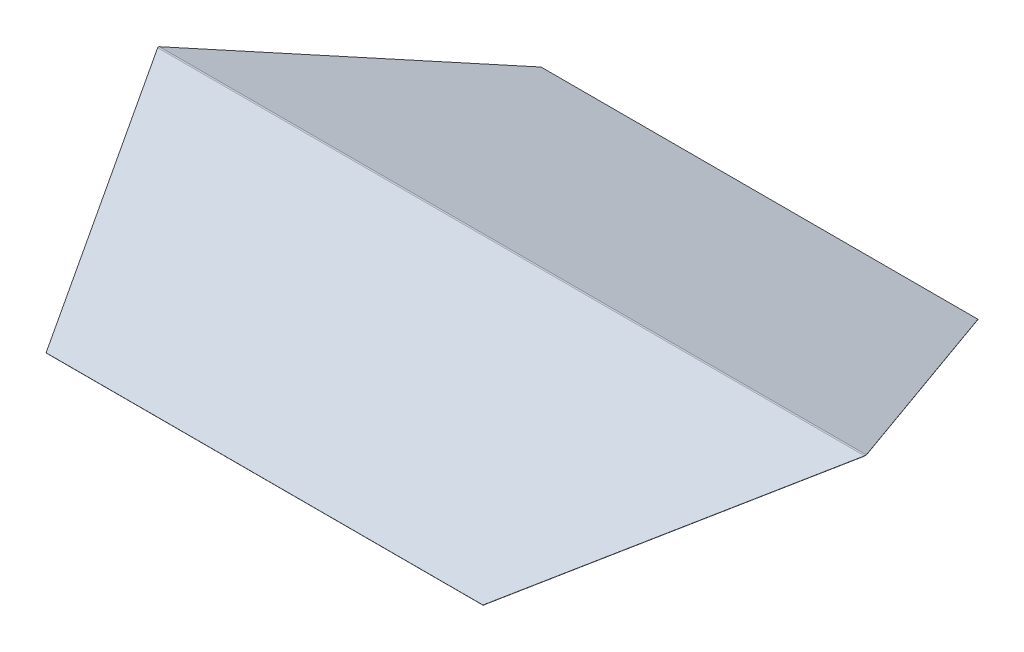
ISO-10303-21;
HEADER;
FILE_DESCRIPTION(('STEP AP214'),'2;1');
FILE_NAME('part.step','',(''),(''),'','','');
FILE_SCHEMA(('AUTOMOTIVE_DESIGN { 1 0 10303 214 1 1 1 1 }'));
ENDSEC;
DATA;
#1=APPLICATION_CONTEXT('core data for automotive mechanical design processes');
#2=APPLICATION_PROTOCOL_DEFINITION('international standard','automotive_design',2000,#1);
#3=PRODUCT_CONTEXT('',#1,'mechanical');
#4=PRODUCT('Part','Part','',(#3));
#5=PRODUCT_RELATED_PRODUCT_CATEGORY('part','',(#4));
#6=PRODUCT_DEFINITION_FORMATION('','',#4);
#7=PRODUCT_DEFINITION_CONTEXT('part definition',#1,'design');
#8=PRODUCT_DEFINITION('design','',#6,#7);
#9=PRODUCT_DEFINITION_SHAPE('','',#8);
#10=(LENGTH_UNIT() NAMED_UNIT(*) SI_UNIT(.MILLI.,.METRE.));
#11=(NAMED_UNIT(*) PLANE_ANGLE_UNIT() SI_UNIT($,.RADIAN.));
#12=(NAMED_UNIT(*) SI_UNIT($,.STERADIAN.) SOLID_ANGLE_UNIT());
#13=UNCERTAINTY_MEASURE_WITH_UNIT(LENGTH_MEASURE(1.E-05),#10,'distance_accuracy_value','');
#14=(GEOMETRIC_REPRESENTATION_CONTEXT(3) GLOBAL_UNCERTAINTY_ASSIGNED_CONTEXT((#13)) GLOBAL_UNIT_ASSIGNED_CONTEXT((#10,
#11,#12)) REPRESENTATION_CONTEXT('',''));
#15=CARTESIAN_POINT('',(0.,0.,0.));
#16=DIRECTION('',(0.,0.,1.));
#17=DIRECTION('',(1.,0.,0.));
#18=AXIS2_PLACEMENT_3D('',#15,#16,#17);
#19=CARTESIAN_POINT('',(-2500.,0.,0.));
#20=DIRECTION('',(1.,0.,0.));
#21=DIRECTION('',(0.,0.,-1.));
#22=AXIS2_PLACEMENT_3D('',#19,#20,#21);
#23=CYLINDRICAL_SURFACE('',#22,20.);
#24=DIRECTION('',(1.,0.,0.));
#25=VECTOR('',#24,1.);
#26=CARTESIAN_POINT('',(-2500.,19.1689404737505,-5.7054115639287));
#27=LINE('',#26,#25);
#28=CARTESIAN_POINT('',(-2500.,19.1689404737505,-5.7054115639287));
#29=VERTEX_POINT('',#28);
#30=CARTESIAN_POINT('',(2500.,19.1689404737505,-5.7054115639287));
#31=VERTEX_POINT('',#30);
#32=EDGE_CURVE('E306',#29,#31,#27,.T.);
#33=ORIENTED_EDGE('',*,*,#32,.T.);
#34=CARTESIAN_POINT('',(2500.,0.,0.));
#35=DIRECTION('',(-1.,0.,0.));
#36=DIRECTION('',(0.,0.,1.));
#37=AXIS2_PLACEMENT_3D('',#34,#35,#36);
#38=CIRCLE('',#37,20.);
#39=CARTESIAN_POINT('',(2500.,19.1689404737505,5.7054115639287));
#40=VERTEX_POINT('',#39);
#41=EDGE_CURVE('E284',#40,#31,#38,.T.);
#42=ORIENTED_EDGE('',*,*,#41,.F.);
#43=DIRECTION('',(1.,0.,0.));
#44=VECTOR('',#43,1.);
#45=CARTESIAN_POINT('',(-2500.,19.1689404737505,5.7054115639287));
#46=LINE('',#45,#44);
#47=CARTESIAN_POINT('',(-2500.,19.1689404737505,5.7054115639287));
#48=VERTEX_POINT('',#47);
#49=EDGE_CURVE('E307',#48,#40,#46,.T.);
#50=ORIENTED_EDGE('',*,*,#49,.F.);
#51=CARTESIAN_POINT('',(-2500.,0.,0.));
#52=DIRECTION('',(-1.,0.,0.));
#53=DIRECTION('',(0.,0.,1.));
#54=AXIS2_PLACEMENT_3D('',#51,#52,#53);
#55=CIRCLE('',#54,20.);
#56=EDGE_CURVE('E295',#48,#29,#55,.T.);
#57=ORIENTED_EDGE('',*,*,#56,.T.);
#58=EDGE_LOOP('',(#33,#42,#50,#57));
#59=FACE_BOUND('',#58,.T.);
#60=ADVANCED_FACE('F35',(#59),#23,.F.);
#61=CARTESIAN_POINT('',(-2500.,19.1689404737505,5.7054115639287));
#62=DIRECTION('',(0.,-0.958447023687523,-0.285270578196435));
#63=DIRECTION('',(0.,0.285270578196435,-0.958447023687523));
#64=AXIS2_PLACEMENT_3D('',#61,#62,#63);
#65=PLANE('',#64);
#66=DIRECTION('',(0.,-0.285270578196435,0.958447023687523));
#67=VECTOR('',#66,1.);
#68=CARTESIAN_POINT('',(-1546.,-14.9999999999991,120.505611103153));
#69=LINE('',#68,#67);
#70=CARTESIAN_POINT('',(-1546.,-14.9999999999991,120.505611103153));
#71=VERTEX_POINT('',#70);
#72=CARTESIAN_POINT('',(-1546.,-499.583728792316,1748.60141938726));
#73=VERTEX_POINT('',#72);
#74=EDGE_CURVE('E180',#71,#73,#69,.T.);
#75=ORIENTED_EDGE('',*,*,#74,.T.);
#76=DIRECTION('',(0.46465968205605,-0.252604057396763,0.848694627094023));
#77=VECTOR('',#76,1.);
#78=CARTESIAN_POINT('',(-2500.18369547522,19.1414420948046,5.79780012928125));
#79=LINE('',#78,#77);
#80=CARTESIAN_POINT('',(-2500.,19.0415792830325,6.1333174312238));
#81=VERTEX_POINT('',#80);
#82=EDGE_CURVE('E272',#81,#73,#79,.T.);
#83=ORIENTED_EDGE('',*,*,#82,.F.);
#84=DIRECTION('',(0.,0.285270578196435,-0.958447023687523));
#85=VECTOR('',#84,1.);
#86=CARTESIAN_POINT('',(-2500.,19.1689404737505,5.7054115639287));
#87=LINE('',#86,#85);
#88=EDGE_CURVE('E304',#81,#48,#87,.T.);
#89=ORIENTED_EDGE('',*,*,#88,.T.);
#90=ORIENTED_EDGE('',*,*,#49,.T.);
#91=DIRECTION('',(0.,0.285270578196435,-0.958447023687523));
#92=VECTOR('',#91,1.);
#93=CARTESIAN_POINT('',(2500.,19.1689404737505,5.7054115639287));
#94=LINE('',#93,#92);
#95=CARTESIAN_POINT('',(2500.,19.0415792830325,6.1333174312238));
#96=VERTEX_POINT('',#95);
#97=EDGE_CURVE('E293',#96,#40,#94,.T.);
#98=ORIENTED_EDGE('',*,*,#97,.F.);
#99=DIRECTION('',(0.46465968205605,0.252604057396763,-0.848694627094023));
#100=VECTOR('',#99,1.);
#101=CARTESIAN_POINT('',(1420.64059483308,-567.733162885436,1977.56867807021));
#102=LINE('',#101,#100);
#103=CARTESIAN_POINT('',(1546.,-499.583728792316,1748.60141938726));
#104=VERTEX_POINT('',#103);
#105=EDGE_CURVE('E256',#104,#96,#102,.T.);
#106=ORIENTED_EDGE('',*,*,#105,.F.);
#107=DIRECTION('',(0.,-0.285270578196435,0.958447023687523));
#108=VECTOR('',#107,1.);
#109=CARTESIAN_POINT('',(1546.,-500.,1750.));
#110=LINE('',#109,#108);
#111=CARTESIAN_POINT('',(1546.,-15.,120.505611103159));
#112=VERTEX_POINT('',#111);
#113=EDGE_CURVE('E57',#112,#104,#110,.T.);
#114=ORIENTED_EDGE('',*,*,#113,.F.);
#115=DIRECTION('',(-1.,0.,0.));
#116=VECTOR('',#115,1.);
#117=CARTESIAN_POINT('',(1546.,-15.,120.505611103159));
#118=LINE('',#117,#116);
#119=CARTESIAN_POINT('',(1545.,-15.,120.505611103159));
#120=VERTEX_POINT('',#119);
#121=EDGE_CURVE('E245',#112,#120,#118,.T.);
#122=ORIENTED_EDGE('',*,*,#121,.T.);
#123=DIRECTION('',(0.,-0.285270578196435,0.958447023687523));
#124=VECTOR('',#123,1.);
#125=CARTESIAN_POINT('',(1545.,-500.,1750.));
#126=LINE('',#125,#124);
#127=CARTESIAN_POINT('',(1545.,-500.,1750.));
#128=VERTEX_POINT('',#127);
#129=EDGE_CURVE('E233',#120,#128,#126,.T.);
#130=ORIENTED_EDGE('',*,*,#129,.T.);
#131=DIRECTION('',(1.,0.,0.));
#132=VECTOR('',#131,1.);
#133=CARTESIAN_POINT('',(-2500.,-500.,1750.));
#134=LINE('',#133,#132);
#135=CARTESIAN_POINT('',(-1545.,-500.,1750.));
#136=VERTEX_POINT('',#135);
#137=EDGE_CURVE('E312',#136,#128,#134,.T.);
#138=ORIENTED_EDGE('',*,*,#137,.F.);
#139=DIRECTION('',(0.,-0.285270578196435,0.958447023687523));
#140=VECTOR('',#139,1.);
#141=CARTESIAN_POINT('',(-1545.,-14.9999999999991,120.505611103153));
#142=LINE('',#141,#140);
#143=CARTESIAN_POINT('',(-1545.,-14.9999999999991,120.505611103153));
#144=VERTEX_POINT('',#143);
#145=EDGE_CURVE('E201',#144,#136,#142,.T.);
#146=ORIENTED_EDGE('',*,*,#145,.F.);
#147=DIRECTION('',(1.,0.,0.));
#148=VECTOR('',#147,1.);
#149=CARTESIAN_POINT('',(-1546.,-14.9999999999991,120.505611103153));
#150=LINE('',#149,#148);
#151=EDGE_CURVE('E211',#71,#144,#150,.T.);
#152=ORIENTED_EDGE('',*,*,#151,.F.);
#153=EDGE_LOOP('',(#75,#83,#89,#90,#98,#106,#114,#122,#130,#138,#146,#152));
#154=FACE_BOUND('',#153,.T.);
#155=ADVANCED_FACE('F374',(#154),#65,.T.);
#156=CARTESIAN_POINT('',(-2500.,-500.,1750.));
#157=DIRECTION('',(0.,-0.285270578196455,0.958447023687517));
#158=DIRECTION('',(0.,-0.958447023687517,-0.285270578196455));
#159=AXIS2_PLACEMENT_3D('',#156,#157,#158);
#160=PLANE('',#159);
#161=DIRECTION('',(0.154314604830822,-0.946966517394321,-0.281853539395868));
#162=VECTOR('',#161,1.);
#163=CARTESIAN_POINT('',(1448.90512534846,91.1331752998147,1925.94389521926));
#164=LINE('',#163,#162);
#165=CARTESIAN_POINT('',(1545.,-498.562329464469,1750.42790586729));
#166=VERTEX_POINT('',#165);
#167=CARTESIAN_POINT('',(1545.23427814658,-500.,1750.));
#168=VERTEX_POINT('',#167);
#169=EDGE_CURVE('E253',#166,#168,#164,.T.);
#170=ORIENTED_EDGE('',*,*,#169,.F.);
#171=DIRECTION('',(1.,0.,0.));
#172=VECTOR('',#171,1.);
#173=CARTESIAN_POINT('',(-2500.,-498.562329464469,1750.42790586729));
#174=LINE('',#173,#172);
#175=CARTESIAN_POINT('',(-1545.,-498.562329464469,1750.42790586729));
#176=VERTEX_POINT('',#175);
#177=EDGE_CURVE('E313',#176,#166,#174,.T.);
#178=ORIENTED_EDGE('',*,*,#177,.F.);
#179=DIRECTION('',(0.154314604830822,0.946966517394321,0.281853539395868));
#180=VECTOR('',#179,1.);
#181=CARTESIAN_POINT('',(-1567.97011166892,-639.520644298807,1708.47330745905));
#182=LINE('',#181,#180);
#183=CARTESIAN_POINT('',(-1545.23427814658,-500.,1750.));
#184=VERTEX_POINT('',#183);
#185=EDGE_CURVE('E270',#184,#176,#182,.T.);
#186=ORIENTED_EDGE('',*,*,#185,.F.);
#187=EDGE_CURVE('E189',#184,#136,#134,.T.);
#188=ORIENTED_EDGE('',*,*,#187,.T.);
#189=ORIENTED_EDGE('',*,*,#137,.T.);
#190=DIRECTION('',(-1.,0.,0.));
#191=VECTOR('',#190,1.);
#192=CARTESIAN_POINT('',(1546.,-500.,1750.));
#193=LINE('',#192,#191);
#194=EDGE_CURVE('E241',#168,#128,#193,.T.);
#195=ORIENTED_EDGE('',*,*,#194,.F.);
#196=EDGE_LOOP('',(#170,#178,#186,#188,#189,#195));
#197=FACE_BOUND('',#196,.T.);
#198=ADVANCED_FACE('F358',(#197),#160,.T.);
#199=CARTESIAN_POINT('',(-2500.,-498.562329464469,1750.42790586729));
#200=DIRECTION('',(0.,0.958447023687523,0.285270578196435));
#201=DIRECTION('',(0.,-0.285270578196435,0.958447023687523));
#202=AXIS2_PLACEMENT_3D('',#199,#200,#201);
#203=PLANE('',#202);
#204=DIRECTION('',(-0.46465968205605,-0.252604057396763,0.848694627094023));
#205=VECTOR('',#204,1.);
#206=CARTESIAN_POINT('',(671.649631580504,-973.343884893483,3345.59054612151));
#207=LINE('',#206,#205);
#208=CARTESIAN_POINT('',(2500.,20.6066110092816,6.1333174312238));
#209=VERTEX_POINT('',#208);
#210=EDGE_CURVE('E251',#209,#166,#207,.T.);
#211=ORIENTED_EDGE('',*,*,#210,.F.);
#212=DIRECTION('',(1.,0.,0.));
#213=VECTOR('',#212,1.);
#214=CARTESIAN_POINT('',(-2500.,20.6066110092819,6.1333174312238));
#215=LINE('',#214,#213);
#216=CARTESIAN_POINT('',(-2500.,20.6066110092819,6.1333174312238));
#217=VERTEX_POINT('',#216);
#218=EDGE_CURVE('E316',#217,#209,#215,.T.);
#219=ORIENTED_EDGE('',*,*,#218,.F.);
#220=DIRECTION('',(-0.46465968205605,0.252604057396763,-0.848694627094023));
#221=VECTOR('',#220,1.);
#222=CARTESIAN_POINT('',(-1751.19273222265,-386.469279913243,1373.81966818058));
#223=LINE('',#222,#221);
#224=EDGE_CURVE('E268',#176,#217,#223,.T.);
#225=ORIENTED_EDGE('',*,*,#224,.F.);
#226=ORIENTED_EDGE('',*,*,#177,.T.);
#227=EDGE_LOOP('',(#211,#219,#225,#226));
#228=FACE_BOUND('',#227,.T.);
#229=ADVANCED_FACE('F351',(#228),#203,.T.);
#230=CARTESIAN_POINT('',(-2500.,0.,0.));
#231=DIRECTION('',(1.,0.,0.));
#232=DIRECTION('',(0.,0.,-1.));
#233=AXIS2_PLACEMENT_3D('',#230,#231,#232);
#234=CYLINDRICAL_SURFACE('',#233,21.5);
#235=ORIENTED_EDGE('',*,*,#218,.T.);
#236=CARTESIAN_POINT('',(2500.,0.,0.));
#237=DIRECTION('',(1.,0.,0.));
#238=DIRECTION('',(0.,0.,1.));
#239=AXIS2_PLACEMENT_3D('',#236,#237,#238);
#240=CIRCLE('',#239,21.5);
#241=CARTESIAN_POINT('',(2500.,20.6066110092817,-6.13331743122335));
#242=VERTEX_POINT('',#241);
#243=EDGE_CURVE('E290',#242,#209,#240,.T.);
#244=ORIENTED_EDGE('',*,*,#243,.F.);
#245=DIRECTION('',(1.,0.,0.));
#246=VECTOR('',#245,1.);
#247=CARTESIAN_POINT('',(-2500.,20.6066110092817,-6.13331743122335));
#248=LINE('',#247,#246);
#249=CARTESIAN_POINT('',(-2500.,20.6066110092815,-6.13331743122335));
#250=VERTEX_POINT('',#249);
#251=EDGE_CURVE('E319',#250,#242,#248,.T.);
#252=ORIENTED_EDGE('',*,*,#251,.F.);
#253=CARTESIAN_POINT('',(-2500.,0.,0.));
#254=DIRECTION('',(1.,0.,0.));
#255=DIRECTION('',(0.,0.,1.));
#256=AXIS2_PLACEMENT_3D('',#253,#254,#255);
#257=CIRCLE('',#256,21.5);
#258=EDGE_CURVE('E301',#250,#217,#257,.T.);
#259=ORIENTED_EDGE('',*,*,#258,.T.);
#260=EDGE_LOOP('',(#235,#244,#252,#259));
#261=FACE_BOUND('',#260,.T.);
#262=ADVANCED_FACE('F346',(#261),#234,.T.);
#263=CARTESIAN_POINT('',(-2500.,-498.562329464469,-1750.42790586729));
#264=DIRECTION('',(0.,0.958447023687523,-0.285270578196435));
#265=DIRECTION('',(0.,0.285270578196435,0.958447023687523));
#266=AXIS2_PLACEMENT_3D('',#263,#264,#265);
#267=PLANE('',#266);
#268=DIRECTION('',(0.464659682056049,0.252604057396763,0.848694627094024));
#269=VECTOR('',#268,1.);
#270=CARTESIAN_POINT('',(671.649631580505,-973.343884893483,-3345.59054612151));
#271=LINE('',#270,#269);
#272=CARTESIAN_POINT('',(1545.,-498.562329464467,-1750.42790586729));
#273=VERTEX_POINT('',#272);
#274=EDGE_CURVE('E266',#273,#242,#271,.T.);
#275=ORIENTED_EDGE('',*,*,#274,.F.);
#276=DIRECTION('',(1.,0.,0.));
#277=VECTOR('',#276,1.);
#278=CARTESIAN_POINT('',(-2500.,-498.562329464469,-1750.42790586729));
#279=LINE('',#278,#277);
#280=CARTESIAN_POINT('',(-1545.,-498.562329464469,-1750.42790586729));
#281=VERTEX_POINT('',#280);
#282=EDGE_CURVE('E322',#281,#273,#279,.T.);
#283=ORIENTED_EDGE('',*,*,#282,.F.);
#284=DIRECTION('',(0.464659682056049,-0.252604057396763,-0.848694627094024));
#285=VECTOR('',#284,1.);
#286=CARTESIAN_POINT('',(-1751.19273222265,-386.469279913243,-1373.81966818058));
#287=LINE('',#286,#285);
#288=EDGE_CURVE('E282',#250,#281,#287,.T.);
#289=ORIENTED_EDGE('',*,*,#288,.F.);
#290=ORIENTED_EDGE('',*,*,#251,.T.);
#291=EDGE_LOOP('',(#275,#283,#289,#290));
#292=FACE_BOUND('',#291,.T.);
#293=ADVANCED_FACE('F342',(#292),#267,.T.);
#294=CARTESIAN_POINT('',(-2500.,-500.,-1750.));
#295=DIRECTION('',(0.,-0.285270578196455,-0.958447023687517));
#296=DIRECTION('',(0.,0.958447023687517,-0.285270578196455));
#297=AXIS2_PLACEMENT_3D('',#294,#295,#296);
#298=PLANE('',#297);
#299=DIRECTION('',(-0.154314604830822,0.946966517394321,-0.281853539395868));
#300=VECTOR('',#299,1.);
#301=CARTESIAN_POINT('',(1448.90512534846,91.1331752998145,-1925.94389521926));
#302=LINE('',#301,#300);
#303=CARTESIAN_POINT('',(1545.23427814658,-500.,-1750.));
#304=VERTEX_POINT('',#303);
#305=EDGE_CURVE('E264',#304,#273,#302,.T.);
#306=ORIENTED_EDGE('',*,*,#305,.F.);
#307=DIRECTION('',(-1.,0.,0.));
#308=VECTOR('',#307,1.);
#309=CARTESIAN_POINT('',(1546.,-500.,-1750.));
#310=LINE('',#309,#308);
#311=CARTESIAN_POINT('',(1545.,-500.,-1750.));
#312=VERTEX_POINT('',#311);
#313=EDGE_CURVE('E228',#304,#312,#310,.T.);
#314=ORIENTED_EDGE('',*,*,#313,.T.);
#315=DIRECTION('',(1.,0.,0.));
#316=VECTOR('',#315,1.);
#317=CARTESIAN_POINT('',(-2500.,-500.,-1750.));
#318=LINE('',#317,#316);
#319=CARTESIAN_POINT('',(-1545.,-500.,-1750.));
#320=VERTEX_POINT('',#319);
#321=EDGE_CURVE('E327',#320,#312,#318,.T.);
#322=ORIENTED_EDGE('',*,*,#321,.F.);
#323=CARTESIAN_POINT('',(-1545.23427814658,-500.,-1750.));
#324=VERTEX_POINT('',#323);
#325=EDGE_CURVE('E325',#324,#320,#318,.T.);
#326=ORIENTED_EDGE('',*,*,#325,.F.);
#327=DIRECTION('',(-0.154314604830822,-0.946966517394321,0.281853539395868));
#328=VECTOR('',#327,1.);
#329=CARTESIAN_POINT('',(-1567.97011166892,-639.520644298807,-1708.47330745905));
#330=LINE('',#329,#328);
#331=EDGE_CURVE('E279',#281,#324,#330,.T.);
#332=ORIENTED_EDGE('',*,*,#331,.F.);
#333=ORIENTED_EDGE('',*,*,#282,.T.);
#334=EDGE_LOOP('',(#306,#314,#322,#326,#332,#333));
#335=FACE_BOUND('',#334,.T.);
#336=ADVANCED_FACE('F390',(#335),#298,.T.);
#337=CARTESIAN_POINT('',(-2500.,19.1689404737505,-5.7054115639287));
#338=DIRECTION('',(0.,-0.958447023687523,0.285270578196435));
#339=DIRECTION('',(0.,-0.285270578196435,-0.958447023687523));
#340=AXIS2_PLACEMENT_3D('',#337,#338,#339);
#341=PLANE('',#340);
#342=DIRECTION('',(0.,0.285270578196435,0.958447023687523));
#343=VECTOR('',#342,1.);
#344=CARTESIAN_POINT('',(-1546.,-500.,-1750.));
#345=LINE('',#344,#343);
#346=CARTESIAN_POINT('',(-1546.,-499.583728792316,-1748.60141938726));
#347=VERTEX_POINT('',#346);
#348=CARTESIAN_POINT('',(-1546.,-15.,-120.505611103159));
#349=VERTEX_POINT('',#348);
#350=EDGE_CURVE('E194',#347,#349,#345,.T.);
#351=ORIENTED_EDGE('',*,*,#350,.T.);
#352=DIRECTION('',(1.,0.,0.));
#353=VECTOR('',#352,1.);
#354=CARTESIAN_POINT('',(-1546.,-15.,-120.505611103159));
#355=LINE('',#354,#353);
#356=CARTESIAN_POINT('',(-1545.,-15.,-120.505611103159));
#357=VERTEX_POINT('',#356);
#358=EDGE_CURVE('E214',#349,#357,#355,.T.);
#359=ORIENTED_EDGE('',*,*,#358,.T.);
#360=DIRECTION('',(0.,0.285270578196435,0.958447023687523));
#361=VECTOR('',#360,1.);
#362=CARTESIAN_POINT('',(-1545.,-500.,-1750.));
#363=LINE('',#362,#361);
#364=EDGE_CURVE('E207',#320,#357,#363,.T.);
#365=ORIENTED_EDGE('',*,*,#364,.F.);
#366=ORIENTED_EDGE('',*,*,#321,.T.);
#367=DIRECTION('',(0.,0.285270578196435,0.958447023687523));
#368=VECTOR('',#367,1.);
#369=CARTESIAN_POINT('',(1545.,-15.,-120.505611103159));
#370=LINE('',#369,#368);
#371=CARTESIAN_POINT('',(1545.,-15.,-120.505611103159));
#372=VERTEX_POINT('',#371);
#373=EDGE_CURVE('E213',#312,#372,#370,.T.);
#374=ORIENTED_EDGE('',*,*,#373,.T.);
#375=DIRECTION('',(-1.,0.,0.));
#376=VECTOR('',#375,1.);
#377=CARTESIAN_POINT('',(1546.,-15.,-120.505611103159));
#378=LINE('',#377,#376);
#379=CARTESIAN_POINT('',(1546.,-15.,-120.505611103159));
#380=VERTEX_POINT('',#379);
#381=EDGE_CURVE('E248',#380,#372,#378,.T.);
#382=ORIENTED_EDGE('',*,*,#381,.F.);
#383=DIRECTION('',(0.,0.285270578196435,0.958447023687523));
#384=VECTOR('',#383,1.);
#385=CARTESIAN_POINT('',(1546.,-15.,-120.505611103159));
#386=LINE('',#385,#384);
#387=CARTESIAN_POINT('',(1546.,-499.583728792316,-1748.60141938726));
#388=VERTEX_POINT('',#387);
#389=EDGE_CURVE('E222',#388,#380,#386,.T.);
#390=ORIENTED_EDGE('',*,*,#389,.F.);
#391=DIRECTION('',(-0.464659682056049,-0.252604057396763,-0.848694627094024));
#392=VECTOR('',#391,1.);
#393=CARTESIAN_POINT('',(1420.64059483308,-567.733162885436,-1977.56867807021));
#394=LINE('',#393,#392);
#395=CARTESIAN_POINT('',(2500.,19.0415792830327,-6.13331743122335));
#396=VERTEX_POINT('',#395);
#397=EDGE_CURVE('E261',#396,#388,#394,.T.);
#398=ORIENTED_EDGE('',*,*,#397,.F.);
#399=DIRECTION('',(0.,-0.285270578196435,-0.958447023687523));
#400=VECTOR('',#399,1.);
#401=CARTESIAN_POINT('',(2500.,19.1689404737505,-5.7054115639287));
#402=LINE('',#401,#400);
#403=EDGE_CURVE('E287',#31,#396,#402,.T.);
#404=ORIENTED_EDGE('',*,*,#403,.F.);
#405=ORIENTED_EDGE('',*,*,#32,.F.);
#406=DIRECTION('',(0.,-0.285270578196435,-0.958447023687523));
#407=VECTOR('',#406,1.);
#408=CARTESIAN_POINT('',(-2500.,19.1689404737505,-5.7054115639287));
#409=LINE('',#408,#407);
#410=CARTESIAN_POINT('',(-2500.,19.0415792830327,-6.13331743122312));
#411=VERTEX_POINT('',#410);
#412=EDGE_CURVE('E298',#29,#411,#409,.T.);
#413=ORIENTED_EDGE('',*,*,#412,.T.);
#414=DIRECTION('',(-0.464659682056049,0.252604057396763,0.848694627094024));
#415=VECTOR('',#414,1.);
#416=CARTESIAN_POINT('',(-2500.18369547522,19.1414420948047,-5.79780012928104));
#417=LINE('',#416,#415);
#418=EDGE_CURVE('E275',#347,#411,#417,.T.);
#419=ORIENTED_EDGE('',*,*,#418,.F.);
#420=EDGE_LOOP('',(#351,#359,#365,#366,#374,#382,#390,#398,#404,#405,#413,#419));
#421=FACE_BOUND('',#420,.T.);
#422=ADVANCED_FACE('F384',(#421),#341,.T.);
#423=CARTESIAN_POINT('',(-2500.,0.,0.));
#424=DIRECTION('',(-1.,0.,0.));
#425=DIRECTION('',(0.,0.,1.));
#426=AXIS2_PLACEMENT_3D('',#423,#424,#425);
#427=PLANE('',#426);
#428=DIRECTION('',(0.,-1.,0.));
#429=VECTOR('',#428,1.);
#430=CARTESIAN_POINT('',(-2500.,0.,6.1333174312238));
#431=LINE('',#430,#429);
#432=EDGE_CURVE('E330',#217,#81,#431,.T.);
#433=ORIENTED_EDGE('',*,*,#432,.F.);
#434=ORIENTED_EDGE('',*,*,#258,.F.);
#435=DIRECTION('',(0.,1.,0.));
#436=VECTOR('',#435,1.);
#437=CARTESIAN_POINT('',(-2500.,0.,-6.13331743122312));
#438=LINE('',#437,#436);
#439=EDGE_CURVE('E310',#411,#250,#438,.T.);
#440=ORIENTED_EDGE('',*,*,#439,.F.);
#441=ORIENTED_EDGE('',*,*,#412,.F.);
#442=ORIENTED_EDGE('',*,*,#56,.F.);
#443=ORIENTED_EDGE('',*,*,#88,.F.);
#444=EDGE_LOOP('',(#433,#434,#440,#441,#442,#443));
#445=FACE_BOUND('',#444,.T.);
#446=ADVANCED_FACE('F408',(#445),#427,.T.);
#447=CARTESIAN_POINT('',(2500.,0.,0.));
#448=DIRECTION('',(-1.,0.,0.));
#449=DIRECTION('',(0.,0.,1.));
#450=AXIS2_PLACEMENT_3D('',#447,#448,#449);
#451=PLANE('',#450);
#452=ORIENTED_EDGE('',*,*,#243,.T.);
#453=DIRECTION('',(0.,-1.,0.));
#454=VECTOR('',#453,1.);
#455=CARTESIAN_POINT('',(2500.,0.,6.1333174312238));
#456=LINE('',#455,#454);
#457=EDGE_CURVE('E11',#209,#96,#456,.T.);
#458=ORIENTED_EDGE('',*,*,#457,.T.);
#459=ORIENTED_EDGE('',*,*,#97,.T.);
#460=ORIENTED_EDGE('',*,*,#41,.T.);
#461=ORIENTED_EDGE('',*,*,#403,.T.);
#462=DIRECTION('',(0.,1.,0.));
#463=VECTOR('',#462,1.);
#464=CARTESIAN_POINT('',(2500.,0.,-6.13331743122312));
#465=LINE('',#464,#463);
#466=EDGE_CURVE('E42',#396,#242,#465,.T.);
#467=ORIENTED_EDGE('',*,*,#466,.T.);
#468=EDGE_LOOP('',(#452,#458,#459,#460,#461,#467));
#469=FACE_BOUND('',#468,.T.);
#470=ADVANCED_FACE('F333',(#469),#451,.F.);
#471=CARTESIAN_POINT('',(-1545.,-500.,-1750.42790586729));
#472=DIRECTION('',(0.877140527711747,0.,0.480233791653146));
#473=DIRECTION('',(0.480233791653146,0.,-0.877140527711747));
#474=AXIS2_PLACEMENT_3D('',#471,#472,#473);
#475=PLANE('',#474);
#476=ORIENTED_EDGE('',*,*,#288,.T.);
#477=ORIENTED_EDGE('',*,*,#331,.T.);
#478=EDGE_CURVE('E276',#324,#347,#417,.T.);
#479=ORIENTED_EDGE('',*,*,#478,.T.);
#480=ORIENTED_EDGE('',*,*,#418,.T.);
#481=ORIENTED_EDGE('',*,*,#439,.T.);
#482=EDGE_LOOP('',(#476,#477,#479,#480,#481));
#483=FACE_BOUND('',#482,.T.);
#484=ADVANCED_FACE('F412',(#483),#475,.F.);
#485=CARTESIAN_POINT('',(-2500.,-500.,6.1333174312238));
#486=DIRECTION('',(0.877140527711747,0.,-0.480233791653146));
#487=DIRECTION('',(-0.480233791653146,0.,-0.877140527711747));
#488=AXIS2_PLACEMENT_3D('',#485,#486,#487);
#489=PLANE('',#488);
#490=ORIENTED_EDGE('',*,*,#82,.T.);
#491=EDGE_CURVE('E176',#73,#184,#79,.T.);
#492=ORIENTED_EDGE('',*,*,#491,.T.);
#493=ORIENTED_EDGE('',*,*,#185,.T.);
#494=ORIENTED_EDGE('',*,*,#224,.T.);
#495=ORIENTED_EDGE('',*,*,#432,.T.);
#496=EDGE_LOOP('',(#490,#492,#493,#494,#495));
#497=FACE_BOUND('',#496,.T.);
#498=ADVANCED_FACE('F461',(#497),#489,.F.);
#499=CARTESIAN_POINT('',(1545.,-500.,-1750.42790586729));
#500=DIRECTION('',(-0.877140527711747,0.,0.480233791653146));
#501=DIRECTION('',(0.480233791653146,0.,0.877140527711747));
#502=AXIS2_PLACEMENT_3D('',#499,#500,#501);
#503=PLANE('',#502);
#504=ORIENTED_EDGE('',*,*,#274,.T.);
#505=ORIENTED_EDGE('',*,*,#466,.F.);
#506=ORIENTED_EDGE('',*,*,#397,.T.);
#507=EDGE_CURVE('E260',#388,#304,#394,.T.);
#508=ORIENTED_EDGE('',*,*,#507,.T.);
#509=ORIENTED_EDGE('',*,*,#305,.T.);
#510=EDGE_LOOP('',(#504,#505,#506,#508,#509));
#511=FACE_BOUND('',#510,.T.);
#512=ADVANCED_FACE('F395',(#511),#503,.F.);
#513=CARTESIAN_POINT('',(2500.,-500.,6.1333174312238));
#514=DIRECTION('',(-0.877140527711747,0.,-0.480233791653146));
#515=DIRECTION('',(-0.480233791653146,0.,0.877140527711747));
#516=AXIS2_PLACEMENT_3D('',#513,#514,#515);
#517=PLANE('',#516);
#518=EDGE_CURVE('E257',#168,#104,#102,.T.);
#519=ORIENTED_EDGE('',*,*,#518,.T.);
#520=ORIENTED_EDGE('',*,*,#105,.T.);
#521=ORIENTED_EDGE('',*,*,#457,.F.);
#522=ORIENTED_EDGE('',*,*,#210,.T.);
#523=ORIENTED_EDGE('',*,*,#169,.T.);
#524=EDGE_LOOP('',(#519,#520,#521,#522,#523));
#525=FACE_BOUND('',#524,.T.);
#526=ADVANCED_FACE('F355',(#525),#517,.F.);
#527=CARTESIAN_POINT('',(1546.,-15.,-120.505611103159));
#528=DIRECTION('',(0.,-0.958447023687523,0.285270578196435));
#529=DIRECTION('',(0.,-0.285270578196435,-0.958447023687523));
#530=AXIS2_PLACEMENT_3D('',#527,#528,#529);
#531=PLANE('',#530);
#532=CARTESIAN_POINT('',(1546.,-500.,-1750.));
#533=VERTEX_POINT('',#532);
#534=EDGE_CURVE('E239',#533,#304,#310,.T.);
#535=ORIENTED_EDGE('',*,*,#534,.T.);
#536=ORIENTED_EDGE('',*,*,#507,.F.);
#537=EDGE_CURVE('E218',#533,#388,#386,.T.);
#538=ORIENTED_EDGE('',*,*,#537,.F.);
#539=EDGE_LOOP('',(#535,#536,#538));
#540=FACE_BOUND('',#539,.T.);
#541=ADVANCED_FACE('F397',(#540),#531,.F.);
#542=CARTESIAN_POINT('',(1546.,-500.,1750.));
#543=DIRECTION('',(0.,-0.958447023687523,-0.285270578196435));
#544=DIRECTION('',(0.,0.285270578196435,-0.958447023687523));
#545=AXIS2_PLACEMENT_3D('',#542,#543,#544);
#546=PLANE('',#545);
#547=CARTESIAN_POINT('',(1546.,-500.,1750.));
#548=VERTEX_POINT('',#547);
#549=EDGE_CURVE('E224',#104,#548,#110,.T.);
#550=ORIENTED_EDGE('',*,*,#549,.F.);
#551=ORIENTED_EDGE('',*,*,#518,.F.);
#552=EDGE_CURVE('E242',#548,#168,#193,.T.);
#553=ORIENTED_EDGE('',*,*,#552,.F.);
#554=EDGE_LOOP('',(#550,#551,#553));
#555=FACE_BOUND('',#554,.T.);
#556=ADVANCED_FACE('F473',(#555),#546,.F.);
#557=CARTESIAN_POINT('',(1546.,-15.,120.505611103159));
#558=DIRECTION('',(0.,-1.,0.));
#559=DIRECTION('',(0.,0.,-1.));
#560=AXIS2_PLACEMENT_3D('',#557,#558,#559);
#561=PLANE('',#560);
#562=DIRECTION('',(0.,0.,1.));
#563=VECTOR('',#562,1.);
#564=CARTESIAN_POINT('',(1545.,-15.,120.505611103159));
#565=LINE('',#564,#563);
#566=EDGE_CURVE('E231',#372,#120,#565,.T.);
#567=ORIENTED_EDGE('',*,*,#566,.T.);
#568=ORIENTED_EDGE('',*,*,#121,.F.);
#569=DIRECTION('',(0.,0.,1.));
#570=VECTOR('',#569,1.);
#571=CARTESIAN_POINT('',(1546.,-15.,120.505611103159));
#572=LINE('',#571,#570);
#573=EDGE_CURVE('E221',#380,#112,#572,.T.);
#574=ORIENTED_EDGE('',*,*,#573,.F.);
#575=ORIENTED_EDGE('',*,*,#381,.T.);
#576=EDGE_LOOP('',(#567,#568,#574,#575));
#577=FACE_BOUND('',#576,.T.);
#578=ADVANCED_FACE('F380',(#577),#561,.F.);
#579=CARTESIAN_POINT('',(1546.,-500.,-1750.));
#580=DIRECTION('',(0.,1.,0.));
#581=DIRECTION('',(0.,0.,1.));
#582=AXIS2_PLACEMENT_3D('',#579,#580,#581);
#583=PLANE('',#582);
#584=DIRECTION('',(0.,0.,-1.));
#585=VECTOR('',#584,1.);
#586=CARTESIAN_POINT('',(1545.,-500.,-1750.));
#587=LINE('',#586,#585);
#588=EDGE_CURVE('E236',#128,#312,#587,.T.);
#589=ORIENTED_EDGE('',*,*,#588,.T.);
#590=ORIENTED_EDGE('',*,*,#313,.F.);
#591=ORIENTED_EDGE('',*,*,#534,.F.);
#592=DIRECTION('',(0.,0.,-1.));
#593=VECTOR('',#592,1.);
#594=CARTESIAN_POINT('',(1546.,-500.,-1750.));
#595=LINE('',#594,#593);
#596=EDGE_CURVE('E226',#548,#533,#595,.T.);
#597=ORIENTED_EDGE('',*,*,#596,.F.);
#598=ORIENTED_EDGE('',*,*,#552,.T.);
#599=ORIENTED_EDGE('',*,*,#194,.T.);
#600=EDGE_LOOP('',(#589,#590,#591,#597,#598,#599));
#601=FACE_BOUND('',#600,.T.);
#602=ADVANCED_FACE('F364',(#601),#583,.F.);
#603=CARTESIAN_POINT('',(1546.,0.,0.));
#604=DIRECTION('',(1.,0.,0.));
#605=DIRECTION('',(0.,0.,-1.));
#606=AXIS2_PLACEMENT_3D('',#603,#604,#605);
#607=PLANE('',#606);
#608=ORIENTED_EDGE('',*,*,#537,.T.);
#609=ORIENTED_EDGE('',*,*,#389,.T.);
#610=ORIENTED_EDGE('',*,*,#573,.T.);
#611=ORIENTED_EDGE('',*,*,#113,.T.);
#612=ORIENTED_EDGE('',*,*,#549,.T.);
#613=ORIENTED_EDGE('',*,*,#596,.T.);
#614=EDGE_LOOP('',(#608,#609,#610,#611,#612,#613));
#615=FACE_BOUND('',#614,.T.);
#616=ADVANCED_FACE('F398',(#615),#607,.T.);
#617=CARTESIAN_POINT('',(1545.,0.,0.));
#618=DIRECTION('',(1.,0.,0.));
#619=DIRECTION('',(0.,0.,-1.));
#620=AXIS2_PLACEMENT_3D('',#617,#618,#619);
#621=PLANE('',#620);
#622=ORIENTED_EDGE('',*,*,#373,.F.);
#623=ORIENTED_EDGE('',*,*,#588,.F.);
#624=ORIENTED_EDGE('',*,*,#129,.F.);
#625=ORIENTED_EDGE('',*,*,#566,.F.);
#626=EDGE_LOOP('',(#622,#623,#624,#625));
#627=FACE_BOUND('',#626,.T.);
#628=ADVANCED_FACE('F371',(#627),#621,.F.);
#629=CARTESIAN_POINT('',(-1546.,-500.,-1750.));
#630=DIRECTION('',(0.,0.958447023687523,-0.285270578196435));
#631=DIRECTION('',(0.,0.285270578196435,0.958447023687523));
#632=AXIS2_PLACEMENT_3D('',#629,#630,#631);
#633=PLANE('',#632);
#634=ORIENTED_EDGE('',*,*,#478,.F.);
#635=DIRECTION('',(1.,0.,0.));
#636=VECTOR('',#635,1.);
#637=CARTESIAN_POINT('',(-1546.,-500.,-1750.));
#638=LINE('',#637,#636);
#639=CARTESIAN_POINT('',(-1546.,-500.,-1750.));
#640=VERTEX_POINT('',#639);
#641=EDGE_CURVE('E190',#640,#324,#638,.T.);
#642=ORIENTED_EDGE('',*,*,#641,.F.);
#643=EDGE_CURVE('E49',#640,#347,#345,.T.);
#644=ORIENTED_EDGE('',*,*,#643,.T.);
#645=EDGE_LOOP('',(#634,#642,#644));
#646=FACE_BOUND('',#645,.T.);
#647=ADVANCED_FACE('F413',(#646),#633,.T.);
#648=CARTESIAN_POINT('',(-1546.,-14.9999999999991,120.505611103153));
#649=DIRECTION('',(0.,0.958447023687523,0.285270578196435));
#650=DIRECTION('',(0.,-0.285270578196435,0.958447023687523));
#651=AXIS2_PLACEMENT_3D('',#648,#649,#650);
#652=PLANE('',#651);
#653=ORIENTED_EDGE('',*,*,#491,.F.);
#654=CARTESIAN_POINT('',(-1546.,-500.,1750.));
#655=VERTEX_POINT('',#654);
#656=EDGE_CURVE('E170',#73,#655,#69,.T.);
#657=ORIENTED_EDGE('',*,*,#656,.T.);
#658=DIRECTION('',(1.,0.,0.));
#659=VECTOR('',#658,1.);
#660=CARTESIAN_POINT('',(-1546.,-500.,1750.));
#661=LINE('',#660,#659);
#662=EDGE_CURVE('E173',#655,#184,#661,.T.);
#663=ORIENTED_EDGE('',*,*,#662,.T.);
#664=EDGE_LOOP('',(#653,#657,#663));
#665=FACE_BOUND('',#664,.T.);
#666=ADVANCED_FACE('F172',(#665),#652,.T.);
#667=CARTESIAN_POINT('',(-1546.,-15.,-120.505611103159));
#668=DIRECTION('',(0.,1.,0.));
#669=DIRECTION('',(0.,0.,1.));
#670=AXIS2_PLACEMENT_3D('',#667,#668,#669);
#671=PLANE('',#670);
#672=DIRECTION('',(0.,0.,1.));
#673=VECTOR('',#672,1.);
#674=CARTESIAN_POINT('',(-1545.,-15.,-120.505611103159));
#675=LINE('',#674,#673);
#676=EDGE_CURVE('E181',#357,#144,#675,.T.);
#677=ORIENTED_EDGE('',*,*,#676,.F.);
#678=ORIENTED_EDGE('',*,*,#358,.F.);
#679=DIRECTION('',(0.,0.,1.));
#680=VECTOR('',#679,1.);
#681=CARTESIAN_POINT('',(-1546.,-15.,-120.505611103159));
#682=LINE('',#681,#680);
#683=EDGE_CURVE('E191',#349,#71,#682,.T.);
#684=ORIENTED_EDGE('',*,*,#683,.T.);
#685=ORIENTED_EDGE('',*,*,#151,.T.);
#686=EDGE_LOOP('',(#677,#678,#684,#685));
#687=FACE_BOUND('',#686,.T.);
#688=ADVANCED_FACE('F420',(#687),#671,.T.);
#689=CARTESIAN_POINT('',(-1546.,-500.,1750.));
#690=DIRECTION('',(0.,-1.,0.));
#691=DIRECTION('',(0.,0.,-1.));
#692=AXIS2_PLACEMENT_3D('',#689,#690,#691);
#693=PLANE('',#692);
#694=DIRECTION('',(0.,0.,-1.));
#695=VECTOR('',#694,1.);
#696=CARTESIAN_POINT('',(-1545.,-500.,1750.));
#697=LINE('',#696,#695);
#698=EDGE_CURVE('E204',#136,#320,#697,.T.);
#699=ORIENTED_EDGE('',*,*,#698,.F.);
#700=ORIENTED_EDGE('',*,*,#187,.F.);
#701=ORIENTED_EDGE('',*,*,#662,.F.);
#702=DIRECTION('',(0.,0.,-1.));
#703=VECTOR('',#702,1.);
#704=CARTESIAN_POINT('',(-1546.,-500.,1750.));
#705=LINE('',#704,#703);
#706=EDGE_CURVE('E187',#655,#640,#705,.T.);
#707=ORIENTED_EDGE('',*,*,#706,.T.);
#708=ORIENTED_EDGE('',*,*,#641,.T.);
#709=ORIENTED_EDGE('',*,*,#325,.T.);
#710=EDGE_LOOP('',(#699,#700,#701,#707,#708,#709));
#711=FACE_BOUND('',#710,.T.);
#712=ADVANCED_FACE('F185',(#711),#693,.T.);
#713=CARTESIAN_POINT('',(-1546.,0.,0.));
#714=DIRECTION('',(-1.,0.,0.));
#715=DIRECTION('',(0.,0.,1.));
#716=AXIS2_PLACEMENT_3D('',#713,#714,#715);
#717=PLANE('',#716);
#718=ORIENTED_EDGE('',*,*,#74,.F.);
#719=ORIENTED_EDGE('',*,*,#683,.F.);
#720=ORIENTED_EDGE('',*,*,#350,.F.);
#721=ORIENTED_EDGE('',*,*,#643,.F.);
#722=ORIENTED_EDGE('',*,*,#706,.F.);
#723=ORIENTED_EDGE('',*,*,#656,.F.);
#724=EDGE_LOOP('',(#718,#719,#720,#721,#722,#723));
#725=FACE_BOUND('',#724,.T.);
#726=ADVANCED_FACE('F193',(#725),#717,.T.);
#727=CARTESIAN_POINT('',(-1545.,0.,0.));
#728=DIRECTION('',(-1.,0.,0.));
#729=DIRECTION('',(0.,0.,1.));
#730=AXIS2_PLACEMENT_3D('',#727,#728,#729);
#731=PLANE('',#730);
#732=ORIENTED_EDGE('',*,*,#145,.T.);
#733=ORIENTED_EDGE('',*,*,#698,.T.);
#734=ORIENTED_EDGE('',*,*,#364,.T.);
#735=ORIENTED_EDGE('',*,*,#676,.T.);
#736=EDGE_LOOP('',(#732,#733,#734,#735));
#737=FACE_BOUND('',#736,.T.);
#738=ADVANCED_FACE('F415',(#737),#731,.F.);
#739=CLOSED_SHELL('',(#60,#155,#198,#229,#262,#293,#336,#422,#446,#470,#484,#498,#512,#526,#541,
#556,#578,#602,#616,#628,#647,#666,#688,#712,#726,#738));
#740=MANIFOLD_SOLID_BREP('B2',#739);
#741=ADVANCED_BREP_SHAPE_REPRESENTATION('',(#18,#740),#14);
#742=SHAPE_DEFINITION_REPRESENTATION(#9,#741);
ENDSEC;
END-ISO-10303-21;
